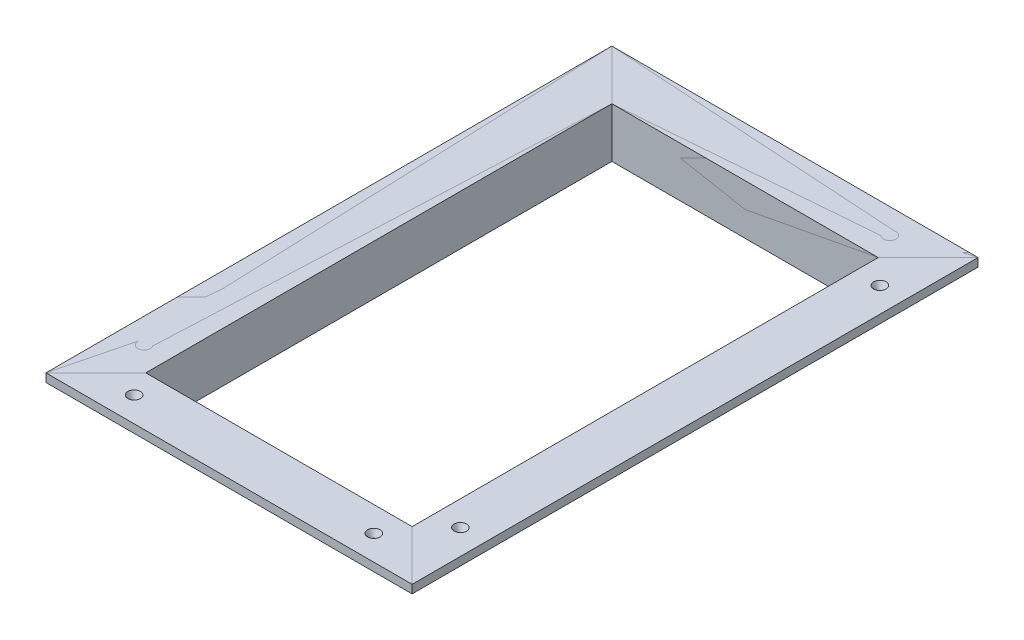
from build123d import *

# Parameters (mm, degrees)
BOSS_EXTRUDE1_DEPTH   = 88.9
BOSS_EXTRUDE1_2_DEPTH = 88.9
SKETCH2_W             = 139.7
SKETCH2_H             = 19.05
BOSS_EXTRUDE2_DEPTH   = 3.175
SKETCH3_W             = 107.95
SKETCH3_H             = 3.175
BOSS_EXTRUDE3_DEPTH   = 15.875
CUT_EXTRUDE1_DEPTH    = 178.573069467
LPATTERN1_COUNT       = 3
LPATTERN1_PITCH       = 22.86
LPATTERN1_COL_COUNT   = 3
LPATTERN1_COL_PITCH   = 22.86
LPATTERN2_COUNT       = 5
LPATTERN2_PITCH       = 22.86
LPATTERN2_COL_COUNT   = 4
LPATTERN2_COL_PITCH   = 22.86
SKETCH8_W             = 9.933860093
SKETCH8_H             = 124.231192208
BOSS_EXTRUDE4_DEPTH   = 3.175
SKETCH9_W             = 61.957853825
SKETCH9_H             = 11.657575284
BOSS_EXTRUDE5_DEPTH   = 3.175
SKETCH10_W            = 11.827023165
SKETCH10_H            = 129.642369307
BOSS_EXTRUDE6_DEPTH   = 3.175
SKETCH11_W            = 61.094329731
SKETCH11_H            = 12.736980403
BOSS_EXTRUDE7_DEPTH   = 3.175


with BuildPart() as part:
    # Sketch1 → Boss-Extrude1 (new, symmetric)
    with BuildSketch(Plane.XY):
        Polygon((0, 0), (19.05, 0), (19.05, -19.05), (15.875, -19.05), (15.875, -3.175), (0, -3.175), align=None)
    extrude(amount=BOSS_EXTRUDE1_DEPTH, both=True)



with BuildPart() as body_2:
    # Sketch1 → Boss-Extrude1 2 (new, symmetric)
    with BuildSketch(Plane.XY):
        Polygon((123.825, -19.05), (120.65, -19.05), (120.65, 0), (139.7, 0), (139.7, -3.175), (123.825, -3.175), align=None)
    extrude(amount=BOSS_EXTRUDE1_2_DEPTH, both=True)


with BuildPart() as part_1:
    add(part.part)

    add(body_2.part)  # Boss-Extrude2 merges body 2
    # Sketch2 → Boss-Extrude2 (add)
    with BuildSketch(Plane(origin=(0, 0, 0), x_dir=(1, 0, 0), z_dir=(0, 1, 0))):
        with Locations((69.85, 98.425)):
            Rectangle(SKETCH2_W, SKETCH2_H)
        with Locations((69.85, -98.425)):
            Rectangle(SKETCH2_W, SKETCH2_H)
    extrude(amount=-BOSS_EXTRUDE2_DEPTH)

    # Sketch3 → Boss-Extrude3 (add)
    with BuildSketch(Plane.XZ.offset(3.175)):
        with Locations((69.85, 90.4875)):
            Rectangle(SKETCH3_W, SKETCH3_H)
        with Locations((69.85, -90.4875)):
            Rectangle(SKETCH3_W, SKETCH3_H)
    extrude(amount=BOSS_EXTRUDE3_DEPTH)

    # Sketch4 → Cut-Extrude1 (cut, through all)
    with BuildSketch(Plane(origin=(0, 0, 0), x_dir=(1, 0, 0), z_dir=(0, 1, 0))):
        Polygon((-0.017960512, 107.932039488), (19.032039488, 88.882039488), (24.614430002, 83.299648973), (24.650351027, 83.335569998), (19.067960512, 88.917960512), (0.017960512, 107.967960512), align=None)
        Polygon((115.085569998, 83.299648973), (115.049648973, 83.335569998), (120.632039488, 88.917960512), (139.682039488, 107.967960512), (139.717960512, 107.932039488), (120.667960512, 88.882039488), align=None)
        Polygon((139.717960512, -107.932039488), (120.667960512, -88.882039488), (115.085569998, -83.299648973), (115.049648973, -83.335569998), (120.632039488, -88.917960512), (139.682039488, -107.967960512), align=None)
        Polygon((24.614430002, -83.299648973), (24.650351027, -83.335569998), (19.067960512, -88.917960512), (0.017960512, -107.967960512), (-0.017960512, -107.932039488), (19.032039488, -88.882039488), align=None)
    extrude(amount=-CUT_EXTRUDE1_DEPTH, mode=Mode.SUBTRACT)


with BuildPart() as cut_extrude1_piece_1:
    # of the separate pieces the step leaves, piece 1, a body of its own (cut_extrude1_pieces)
    add(part_1.part.solids().sort_by_distance((0, 0, -107.914078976))[0])


with BuildPart() as cut_extrude1_piece_2:
    # of the separate pieces the step leaves, piece 2, a body of its own (cut_extrude1_pieces)
    add(part_1.part.solids().sort_by_distance((139.7, 0, -107.914078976))[0])

    # Sketch7 → Cut-Revolve12 (revolve, cut)
    with BuildSketch(Plane(origin=(0, 0, -11.43), x_dir=(-1, 0, 0), z_dir=(0, 0, -1)), mode=Mode.PRIVATE) as cut_revolve12_sk:
        Polygon((-130.175, -4.48925948), (-130.175, 1.441207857), (-132.55625, 1.441207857), (-132.55625, 0), (-131.27752216, -2.380867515), (-131.27752216, -4.48925948), align=None)
    cut_revolve12 = revolve(cut_revolve12_sk.sketch.rotate(Axis((130.175, -4.48925948, -11.43), (0, 1, 0)), 90), axis=Axis((130.175, -4.48925948, -11.43), (0, 1, 0)), mode=Mode.SUBTRACT)

    # LPattern2: Cut-Revolve12 ×5
    with Locations(*[(0, 0, i * LPATTERN2_PITCH) for i in range(1, LPATTERN2_COUNT)]):
        add(cut_revolve12, mode=Mode.SUBTRACT)

    # LPattern2 col: Cut-Revolve12 ×4
    with Locations(*[(0, 0, -i * LPATTERN2_COL_PITCH) for i in range(1, LPATTERN2_COL_COUNT)]):
        add(cut_revolve12, mode=Mode.SUBTRACT)


with BuildPart() as cut_extrude1_piece_3:
    # of the separate pieces the step leaves, piece 3, a body of its own (cut_extrude1_pieces)
    add(part_1.part.solids().sort_by_distance((0.035921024, 0, -107.95))[0])


with BuildPart() as cut_extrude1_piece_4:
    # of the separate pieces the step leaves, piece 4, a body of its own (cut_extrude1_pieces)
    add(part_1.part.solids().sort_by_distance((139.664078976, 0, 107.95))[0])

    # Sketch5 → Cut-Revolve11 (revolve, cut)
    with BuildSketch(Plane(origin=(69.85, 0, 0), x_dir=(0, 0, -1), z_dir=(1, 0, 0)), mode=Mode.PRIVATE) as cut_revolve11_sk:
        Polygon((-98.425, -4.48925948), (-98.425, 1.441207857), (-100.80625, 1.441207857), (-100.80625, 0), (-99.52752216, -2.380867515), (-99.52752216, -4.48925948), align=None)
    cut_revolve11 = revolve(cut_revolve11_sk.sketch.rotate(Axis((69.85, -4.48925948, 98.425), (0, 1, 0)), 180), axis=Axis((69.85, -4.48925948, 98.425), (0, 1, 0)), mode=Mode.SUBTRACT)

    # LPattern1: Cut-Revolve11 ×3
    with Locations(*[(i * LPATTERN1_PITCH, 0, 0) for i in range(1, LPATTERN1_COUNT)]):
        add(cut_revolve11, mode=Mode.SUBTRACT)

    # LPattern1 col: Cut-Revolve11 ×3
    with Locations(*[(-i * LPATTERN1_COL_PITCH, 0, 0) for i in range(1, LPATTERN1_COL_COUNT)]):
        add(cut_revolve11, mode=Mode.SUBTRACT)


with BuildPart() as body_5:
    # Mirror2: mirrored copy
    add(cut_extrude1_piece_4.part.mirror(Plane(origin=(0, 0, 0), x_dir=(1, 0, 0), z_dir=(0, 0, -1))))

    # Sketch11 → Boss-Extrude7 (add)
    with BuildSketch(Plane(origin=(0, 0, 0), x_dir=(1, 0, 0), z_dir=(0, 1, 0))):
        with Locations((68.178167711, 98.306267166)):
            Rectangle(SKETCH11_W, SKETCH11_H)
    extrude(amount=-BOSS_EXTRUDE7_DEPTH)


with BuildPart() as body_6:
    # Mirror3: mirrored copy
    add(cut_extrude1_piece_2.part.mirror(Plane(origin=(69.85, 0, 0), x_dir=(0, 0, 1), z_dir=(1, 0, 0))))

    # Sketch8 → Boss-Extrude4 (add)
    with BuildSketch(Plane(origin=(0, 0, 0), x_dir=(1, 0, 0), z_dir=(0, 1, 0))):
        with Locations((9.029540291, 0.200138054)):
            Rectangle(SKETCH8_W, SKETCH8_H)
    extrude(amount=-BOSS_EXTRUDE4_DEPTH)


with BuildPart() as cut_extrude1_piece_4_1:
    add(cut_extrude1_piece_4.part)

    # Sketch9 → Boss-Extrude5 (add)
    with BuildSketch(Plane(origin=(0, 0, 0), x_dir=(1, 0, 0), z_dir=(0, 1, 0))):
        with Locations((70.120072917, -98.992966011)):
            Rectangle(SKETCH9_W, SKETCH9_H)
    extrude(amount=-BOSS_EXTRUDE5_DEPTH)


with BuildPart() as cut_extrude1_piece_2_1:
    add(cut_extrude1_piece_2.part)

    # Sketch10 → Boss-Extrude6 (add)
    with BuildSketch(Plane(origin=(0, 0, 0), x_dir=(1, 0, 0), z_dir=(0, 1, 0))):
        with Locations((129.894886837, -0.454885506)):
            Rectangle(SKETCH10_W, SKETCH10_H)
    extrude(amount=-BOSS_EXTRUDE6_DEPTH)


solid = Compound([cut_extrude1_piece_1.part, cut_extrude1_piece_3.part, body_5.part, body_6.part, cut_extrude1_piece_4_1.part, cut_extrude1_piece_2_1.part])
